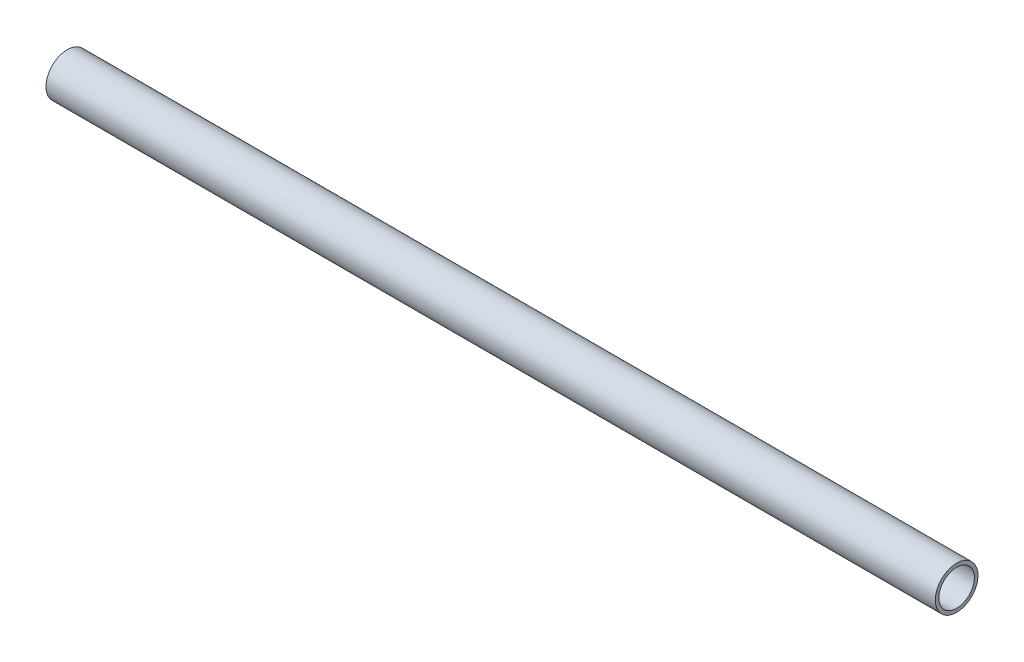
ISO-10303-21;
HEADER;
FILE_DESCRIPTION(('STEP AP214'),'2;1');
FILE_NAME('part.step','',(''),(''),'','','');
FILE_SCHEMA(('AUTOMOTIVE_DESIGN { 1 0 10303 214 1 1 1 1 }'));
ENDSEC;
DATA;
#1=APPLICATION_CONTEXT('core data for automotive mechanical design processes');
#2=APPLICATION_PROTOCOL_DEFINITION('international standard','automotive_design',2000,#1);
#3=PRODUCT_CONTEXT('',#1,'mechanical');
#4=PRODUCT('Part','Part','',(#3));
#5=PRODUCT_RELATED_PRODUCT_CATEGORY('part','',(#4));
#6=PRODUCT_DEFINITION_FORMATION('','',#4);
#7=PRODUCT_DEFINITION_CONTEXT('part definition',#1,'design');
#8=PRODUCT_DEFINITION('design','',#6,#7);
#9=PRODUCT_DEFINITION_SHAPE('','',#8);
#10=(LENGTH_UNIT() NAMED_UNIT(*) SI_UNIT(.MILLI.,.METRE.));
#11=(NAMED_UNIT(*) PLANE_ANGLE_UNIT() SI_UNIT($,.RADIAN.));
#12=(NAMED_UNIT(*) SI_UNIT($,.STERADIAN.) SOLID_ANGLE_UNIT());
#13=UNCERTAINTY_MEASURE_WITH_UNIT(LENGTH_MEASURE(1.E-05),#10,'distance_accuracy_value','');
#14=(GEOMETRIC_REPRESENTATION_CONTEXT(3) GLOBAL_UNCERTAINTY_ASSIGNED_CONTEXT((#13)) GLOBAL_UNIT_ASSIGNED_CONTEXT((#10,
#11,#12)) REPRESENTATION_CONTEXT('',''));
#15=CARTESIAN_POINT('',(0.,0.,0.));
#16=DIRECTION('',(0.,0.,1.));
#17=DIRECTION('',(1.,0.,0.));
#18=AXIS2_PLACEMENT_3D('',#15,#16,#17);
#19=CARTESIAN_POINT('',(5000.,0.,0.));
#20=DIRECTION('',(1.,0.,0.));
#21=DIRECTION('',(0.,0.,-1.));
#22=AXIS2_PLACEMENT_3D('',#19,#20,#21);
#23=PLANE('',#22);
#24=CARTESIAN_POINT('',(5000.,0.,0.));
#25=DIRECTION('',(1.,0.,0.));
#26=DIRECTION('',(0.,0.,-1.));
#27=AXIS2_PLACEMENT_3D('',#24,#25,#26);
#28=CIRCLE('',#27,120.);
#29=CARTESIAN_POINT('',(5000.,0.,-120.));
#30=VERTEX_POINT('',#29);
#31=EDGE_CURVE('E10',#30,#30,#28,.T.);
#32=ORIENTED_EDGE('',*,*,#31,.T.);
#33=EDGE_LOOP('',(#32));
#34=FACE_BOUND('',#33,.T.);
#35=CARTESIAN_POINT('',(5000.,0.,0.));
#36=DIRECTION('',(1.,0.,0.));
#37=DIRECTION('',(0.,0.,-1.));
#38=AXIS2_PLACEMENT_3D('',#35,#36,#37);
#39=CIRCLE('',#38,100.);
#40=CARTESIAN_POINT('',(5000.,0.,-100.));
#41=VERTEX_POINT('',#40);
#42=EDGE_CURVE('E43',#41,#41,#39,.T.);
#43=ORIENTED_EDGE('',*,*,#42,.F.);
#44=EDGE_LOOP('',(#43));
#45=FACE_BOUND('',#44,.T.);
#46=ADVANCED_FACE('F32',(#34,#45),#23,.T.);
#47=CARTESIAN_POINT('',(0.,0.,0.));
#48=DIRECTION('',(1.,0.,0.));
#49=DIRECTION('',(0.,0.,-1.));
#50=AXIS2_PLACEMENT_3D('',#47,#48,#49);
#51=PLANE('',#50);
#52=CARTESIAN_POINT('',(0.,0.,0.));
#53=DIRECTION('',(1.,0.,0.));
#54=DIRECTION('',(0.,0.,-1.));
#55=AXIS2_PLACEMENT_3D('',#52,#53,#54);
#56=CIRCLE('',#55,120.);
#57=CARTESIAN_POINT('',(0.,0.,-120.));
#58=VERTEX_POINT('',#57);
#59=EDGE_CURVE('E36',#58,#58,#56,.T.);
#60=ORIENTED_EDGE('',*,*,#59,.F.);
#61=EDGE_LOOP('',(#60));
#62=FACE_BOUND('',#61,.T.);
#63=CARTESIAN_POINT('',(0.,0.,0.));
#64=DIRECTION('',(1.,0.,0.));
#65=DIRECTION('',(0.,0.,-1.));
#66=AXIS2_PLACEMENT_3D('',#63,#64,#65);
#67=CIRCLE('',#66,100.);
#68=CARTESIAN_POINT('',(0.,0.,-100.));
#69=VERTEX_POINT('',#68);
#70=EDGE_CURVE('E45',#69,#69,#67,.T.);
#71=ORIENTED_EDGE('',*,*,#70,.T.);
#72=EDGE_LOOP('',(#71));
#73=FACE_BOUND('',#72,.T.);
#74=ADVANCED_FACE('F55',(#62,#73),#51,.F.);
#75=CARTESIAN_POINT('',(5000.,0.,0.));
#76=DIRECTION('',(-1.,0.,0.));
#77=DIRECTION('',(0.,0.,1.));
#78=AXIS2_PLACEMENT_3D('',#75,#76,#77);
#79=CYLINDRICAL_SURFACE('',#78,120.);
#80=ORIENTED_EDGE('',*,*,#31,.F.);
#81=EDGE_LOOP('',(#80));
#82=FACE_BOUND('',#81,.T.);
#83=ORIENTED_EDGE('',*,*,#59,.T.);
#84=EDGE_LOOP('',(#83));
#85=FACE_BOUND('',#84,.T.);
#86=ADVANCED_FACE('F34',(#82,#85),#79,.T.);
#87=CARTESIAN_POINT('',(5000.,0.,0.));
#88=DIRECTION('',(-1.,0.,0.));
#89=DIRECTION('',(0.,0.,1.));
#90=AXIS2_PLACEMENT_3D('',#87,#88,#89);
#91=CYLINDRICAL_SURFACE('',#90,100.);
#92=ORIENTED_EDGE('',*,*,#42,.T.);
#93=EDGE_LOOP('',(#92));
#94=FACE_BOUND('',#93,.T.);
#95=ORIENTED_EDGE('',*,*,#70,.F.);
#96=EDGE_LOOP('',(#95));
#97=FACE_BOUND('',#96,.T.);
#98=ADVANCED_FACE('F51',(#94,#97),#91,.F.);
#99=CLOSED_SHELL('',(#46,#74,#86,#98));
#100=MANIFOLD_SOLID_BREP('B2',#99);
#101=ADVANCED_BREP_SHAPE_REPRESENTATION('',(#18,#100),#14);
#102=SHAPE_DEFINITION_REPRESENTATION(#9,#101);
ENDSEC;
END-ISO-10303-21;
